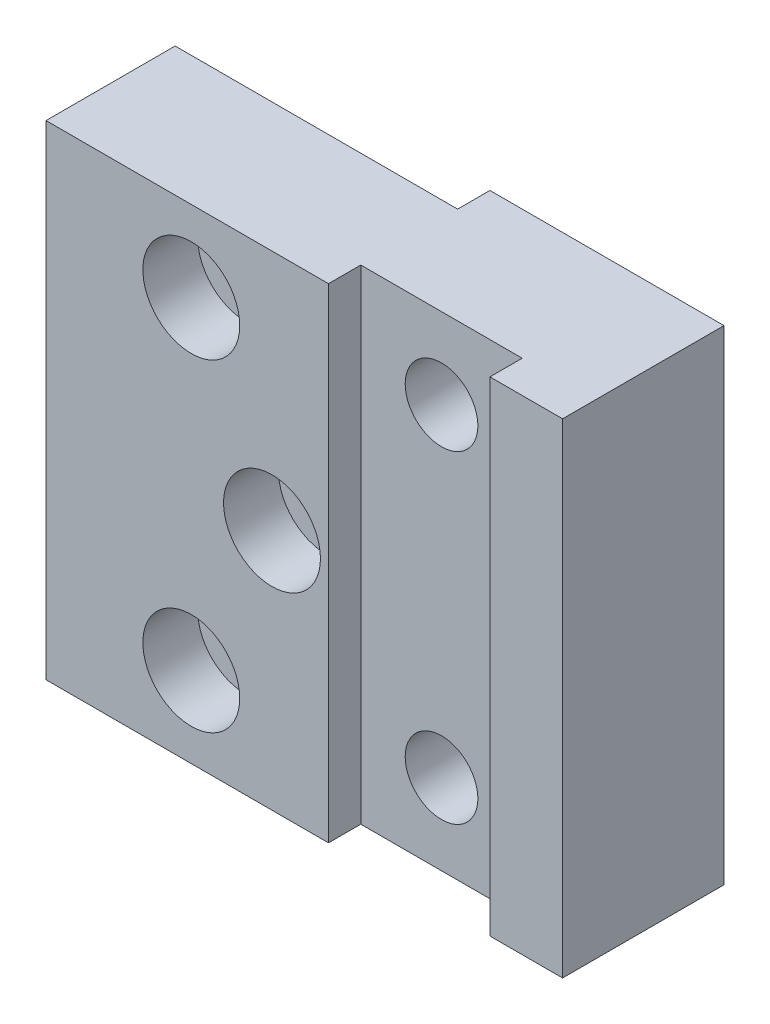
ISO-10303-21;
HEADER;
FILE_DESCRIPTION(('STEP AP214'),'2;1');
FILE_NAME('part.step','',(''),(''),'','','');
FILE_SCHEMA(('AUTOMOTIVE_DESIGN { 1 0 10303 214 1 1 1 1 }'));
ENDSEC;
DATA;
#1=APPLICATION_CONTEXT('core data for automotive mechanical design processes');
#2=APPLICATION_PROTOCOL_DEFINITION('international standard','automotive_design',2000,#1);
#3=PRODUCT_CONTEXT('',#1,'mechanical');
#4=PRODUCT('Part','Part','',(#3));
#5=PRODUCT_RELATED_PRODUCT_CATEGORY('part','',(#4));
#6=PRODUCT_DEFINITION_FORMATION('','',#4);
#7=PRODUCT_DEFINITION_CONTEXT('part definition',#1,'design');
#8=PRODUCT_DEFINITION('design','',#6,#7);
#9=PRODUCT_DEFINITION_SHAPE('','',#8);
#10=(LENGTH_UNIT() NAMED_UNIT(*) SI_UNIT(.MILLI.,.METRE.));
#11=(NAMED_UNIT(*) PLANE_ANGLE_UNIT() SI_UNIT($,.RADIAN.));
#12=(NAMED_UNIT(*) SI_UNIT($,.STERADIAN.) SOLID_ANGLE_UNIT());
#13=UNCERTAINTY_MEASURE_WITH_UNIT(LENGTH_MEASURE(1.E-05),#10,'distance_accuracy_value','');
#14=(GEOMETRIC_REPRESENTATION_CONTEXT(3) GLOBAL_UNCERTAINTY_ASSIGNED_CONTEXT((#13)) GLOBAL_UNIT_ASSIGNED_CONTEXT((#10,
#11,#12)) REPRESENTATION_CONTEXT('',''));
#15=CARTESIAN_POINT('',(0.,0.,0.));
#16=DIRECTION('',(0.,0.,1.));
#17=DIRECTION('',(1.,0.,0.));
#18=AXIS2_PLACEMENT_3D('',#15,#16,#17);
#19=CARTESIAN_POINT('',(0.,0.,10.));
#20=DIRECTION('',(0.,0.,-1.));
#21=DIRECTION('',(-1.,0.,0.));
#22=AXIS2_PLACEMENT_3D('',#19,#20,#21);
#23=PLANE('',#22);
#24=CARTESIAN_POINT('',(5.8,-10.,10.));
#25=DIRECTION('',(0.,0.,1.));
#26=DIRECTION('',(1.,0.,0.));
#27=AXIS2_PLACEMENT_3D('',#24,#25,#26);
#28=CIRCLE('',#27,3.);
#29=CARTESIAN_POINT('',(8.8,-10.,10.));
#30=VERTEX_POINT('',#29);
#31=EDGE_CURVE('E153',#30,#30,#28,.T.);
#32=ORIENTED_EDGE('',*,*,#31,.F.);
#33=EDGE_LOOP('',(#32));
#34=FACE_BOUND('',#33,.T.);
#35=CARTESIAN_POINT('',(10.8,0.,10.));
#36=DIRECTION('',(0.,0.,1.));
#37=DIRECTION('',(1.,0.,0.));
#38=AXIS2_PLACEMENT_3D('',#35,#36,#37);
#39=CIRCLE('',#38,3.);
#40=CARTESIAN_POINT('',(13.8,0.,10.));
#41=VERTEX_POINT('',#40);
#42=EDGE_CURVE('E157',#41,#41,#39,.T.);
#43=ORIENTED_EDGE('',*,*,#42,.F.);
#44=EDGE_LOOP('',(#43));
#45=FACE_BOUND('',#44,.T.);
#46=CARTESIAN_POINT('',(5.8,10.,10.));
#47=DIRECTION('',(0.,0.,1.));
#48=DIRECTION('',(1.,0.,0.));
#49=AXIS2_PLACEMENT_3D('',#46,#47,#48);
#50=CIRCLE('',#49,3.);
#51=CARTESIAN_POINT('',(8.8,10.,10.));
#52=VERTEX_POINT('',#51);
#53=EDGE_CURVE('E184',#52,#52,#50,.T.);
#54=ORIENTED_EDGE('',*,*,#53,.F.);
#55=EDGE_LOOP('',(#54));
#56=FACE_BOUND('',#55,.T.);
#57=DIRECTION('',(1.,0.,0.));
#58=VECTOR('',#57,1.);
#59=CARTESIAN_POINT('',(-3.2,-15.,10.));
#60=LINE('',#59,#58);
#61=CARTESIAN_POINT('',(-3.2,-15.,10.));
#62=VERTEX_POINT('',#61);
#63=CARTESIAN_POINT('',(14.3,-15.,10.));
#64=VERTEX_POINT('',#63);
#65=EDGE_CURVE('E110',#62,#64,#60,.T.);
#66=ORIENTED_EDGE('',*,*,#65,.T.);
#67=DIRECTION('',(0.,1.,0.));
#68=VECTOR('',#67,1.);
#69=CARTESIAN_POINT('',(14.3,-15.,10.));
#70=LINE('',#69,#68);
#71=CARTESIAN_POINT('',(14.3,15.,10.));
#72=VERTEX_POINT('',#71);
#73=EDGE_CURVE('E95',#64,#72,#70,.T.);
#74=ORIENTED_EDGE('',*,*,#73,.T.);
#75=DIRECTION('',(-1.,0.,0.));
#76=VECTOR('',#75,1.);
#77=CARTESIAN_POINT('',(-3.2,15.,10.));
#78=LINE('',#77,#76);
#79=CARTESIAN_POINT('',(-3.2,15.,10.));
#80=VERTEX_POINT('',#79);
#81=EDGE_CURVE('E121',#72,#80,#78,.T.);
#82=ORIENTED_EDGE('',*,*,#81,.T.);
#83=DIRECTION('',(0.,-1.,0.));
#84=VECTOR('',#83,1.);
#85=CARTESIAN_POINT('',(-3.2,-15.,10.));
#86=LINE('',#85,#84);
#87=EDGE_CURVE('E116',#80,#62,#86,.T.);
#88=ORIENTED_EDGE('',*,*,#87,.T.);
#89=EDGE_LOOP('',(#66,#74,#82,#88));
#90=FACE_BOUND('',#89,.T.);
#91=ADVANCED_FACE('F16',(#34,#45,#56,#90),#23,.F.);
#92=CARTESIAN_POINT('',(-3.2,-15.,10.));
#93=DIRECTION('',(1.,0.,0.));
#94=DIRECTION('',(0.,0.,-1.));
#95=AXIS2_PLACEMENT_3D('',#92,#93,#94);
#96=PLANE('',#95);
#97=DIRECTION('',(0.,0.,-1.));
#98=VECTOR('',#97,1.);
#99=CARTESIAN_POINT('',(-3.2,15.,10.));
#100=LINE('',#99,#98);
#101=CARTESIAN_POINT('',(-3.2,15.,2.));
#102=VERTEX_POINT('',#101);
#103=EDGE_CURVE('E129',#80,#102,#100,.T.);
#104=ORIENTED_EDGE('',*,*,#103,.T.);
#105=DIRECTION('',(0.,1.,0.));
#106=VECTOR('',#105,1.);
#107=CARTESIAN_POINT('',(-3.2,-15.,2.));
#108=LINE('',#107,#106);
#109=CARTESIAN_POINT('',(-3.2,-15.,2.));
#110=VERTEX_POINT('',#109);
#111=EDGE_CURVE('E215',#110,#102,#108,.T.);
#112=ORIENTED_EDGE('',*,*,#111,.F.);
#113=DIRECTION('',(0.,0.,-1.));
#114=VECTOR('',#113,1.);
#115=CARTESIAN_POINT('',(-3.2,-15.,10.));
#116=LINE('',#115,#114);
#117=EDGE_CURVE('E11',#62,#110,#116,.T.);
#118=ORIENTED_EDGE('',*,*,#117,.F.);
#119=ORIENTED_EDGE('',*,*,#87,.F.);
#120=EDGE_LOOP('',(#104,#112,#118,#119));
#121=FACE_BOUND('',#120,.T.);
#122=ADVANCED_FACE('F18',(#121),#96,.F.);
#123=CARTESIAN_POINT('',(-3.2,-15.,10.));
#124=DIRECTION('',(0.,1.,0.));
#125=DIRECTION('',(0.,0.,1.));
#126=AXIS2_PLACEMENT_3D('',#123,#124,#125);
#127=PLANE('',#126);
#128=DIRECTION('',(-1.,0.,0.));
#129=VECTOR('',#128,1.);
#130=CARTESIAN_POINT('',(14.3,-15.,8.));
#131=LINE('',#130,#129);
#132=CARTESIAN_POINT('',(24.3,-15.,8.));
#133=VERTEX_POINT('',#132);
#134=CARTESIAN_POINT('',(14.3,-15.,8.));
#135=VERTEX_POINT('',#134);
#136=EDGE_CURVE('E106',#133,#135,#131,.T.);
#137=ORIENTED_EDGE('',*,*,#136,.T.);
#138=DIRECTION('',(0.,0.,1.));
#139=VECTOR('',#138,1.);
#140=CARTESIAN_POINT('',(14.3,-15.,10.));
#141=LINE('',#140,#139);
#142=EDGE_CURVE('E98',#135,#64,#141,.T.);
#143=ORIENTED_EDGE('',*,*,#142,.T.);
#144=ORIENTED_EDGE('',*,*,#65,.F.);
#145=ORIENTED_EDGE('',*,*,#117,.T.);
#146=DIRECTION('',(1.,0.,0.));
#147=VECTOR('',#146,1.);
#148=CARTESIAN_POINT('',(-3.2,-15.,2.));
#149=LINE('',#148,#147);
#150=CARTESIAN_POINT('',(14.3,-15.,2.));
#151=VERTEX_POINT('',#150);
#152=EDGE_CURVE('E209',#110,#151,#149,.T.);
#153=ORIENTED_EDGE('',*,*,#152,.T.);
#154=DIRECTION('',(0.,0.,-1.));
#155=VECTOR('',#154,1.);
#156=CARTESIAN_POINT('',(14.3,-15.,0.));
#157=LINE('',#156,#155);
#158=CARTESIAN_POINT('',(14.3,-15.,0.));
#159=VERTEX_POINT('',#158);
#160=EDGE_CURVE('E212',#151,#159,#157,.T.);
#161=ORIENTED_EDGE('',*,*,#160,.T.);
#162=DIRECTION('',(1.,0.,0.));
#163=VECTOR('',#162,1.);
#164=CARTESIAN_POINT('',(-3.2,-15.,0.));
#165=LINE('',#164,#163);
#166=CARTESIAN_POINT('',(28.8,-15.,0.));
#167=VERTEX_POINT('',#166);
#168=EDGE_CURVE('E130',#159,#167,#165,.T.);
#169=ORIENTED_EDGE('',*,*,#168,.T.);
#170=DIRECTION('',(0.,0.,-1.));
#171=VECTOR('',#170,1.);
#172=CARTESIAN_POINT('',(28.8,-15.,10.));
#173=LINE('',#172,#171);
#174=CARTESIAN_POINT('',(28.8,-15.,10.));
#175=VERTEX_POINT('',#174);
#176=EDGE_CURVE('E25',#175,#167,#173,.T.);
#177=ORIENTED_EDGE('',*,*,#176,.F.);
#178=CARTESIAN_POINT('',(24.3,-15.,10.));
#179=VERTEX_POINT('',#178);
#180=EDGE_CURVE('E119',#179,#175,#60,.T.);
#181=ORIENTED_EDGE('',*,*,#180,.F.);
#182=DIRECTION('',(0.,0.,-1.));
#183=VECTOR('',#182,1.);
#184=CARTESIAN_POINT('',(24.3,-15.,10.));
#185=LINE('',#184,#183);
#186=EDGE_CURVE('E33',#179,#133,#185,.T.);
#187=ORIENTED_EDGE('',*,*,#186,.T.);
#188=EDGE_LOOP('',(#137,#143,#144,#145,#153,#161,#169,#177,#181,#187));
#189=FACE_BOUND('',#188,.T.);
#190=ADVANCED_FACE('F109',(#189),#127,.F.);
#191=CARTESIAN_POINT('',(28.8,-15.,10.));
#192=DIRECTION('',(-1.,0.,0.));
#193=DIRECTION('',(0.,0.,1.));
#194=AXIS2_PLACEMENT_3D('',#191,#192,#193);
#195=PLANE('',#194);
#196=DIRECTION('',(0.,1.,0.));
#197=VECTOR('',#196,1.);
#198=CARTESIAN_POINT('',(28.8,-15.,0.));
#199=LINE('',#198,#197);
#200=CARTESIAN_POINT('',(28.8,15.,0.));
#201=VERTEX_POINT('',#200);
#202=EDGE_CURVE('E132',#167,#201,#199,.T.);
#203=ORIENTED_EDGE('',*,*,#202,.T.);
#204=DIRECTION('',(0.,0.,-1.));
#205=VECTOR('',#204,1.);
#206=CARTESIAN_POINT('',(28.8,15.,10.));
#207=LINE('',#206,#205);
#208=CARTESIAN_POINT('',(28.8,15.,10.));
#209=VERTEX_POINT('',#208);
#210=EDGE_CURVE('E140',#209,#201,#207,.T.);
#211=ORIENTED_EDGE('',*,*,#210,.F.);
#212=DIRECTION('',(0.,1.,0.));
#213=VECTOR('',#212,1.);
#214=CARTESIAN_POINT('',(28.8,-15.,10.));
#215=LINE('',#214,#213);
#216=EDGE_CURVE('E118',#175,#209,#215,.T.);
#217=ORIENTED_EDGE('',*,*,#216,.F.);
#218=ORIENTED_EDGE('',*,*,#176,.T.);
#219=EDGE_LOOP('',(#203,#211,#217,#218));
#220=FACE_BOUND('',#219,.T.);
#221=ADVANCED_FACE('F238',(#220),#195,.F.);
#222=CARTESIAN_POINT('',(-3.2,15.,10.));
#223=DIRECTION('',(0.,-1.,0.));
#224=DIRECTION('',(0.,0.,-1.));
#225=AXIS2_PLACEMENT_3D('',#222,#223,#224);
#226=PLANE('',#225);
#227=ORIENTED_EDGE('',*,*,#81,.F.);
#228=DIRECTION('',(0.,0.,1.));
#229=VECTOR('',#228,1.);
#230=CARTESIAN_POINT('',(14.3,15.,10.));
#231=LINE('',#230,#229);
#232=CARTESIAN_POINT('',(14.3,15.,8.));
#233=VERTEX_POINT('',#232);
#234=EDGE_CURVE('E101',#233,#72,#231,.T.);
#235=ORIENTED_EDGE('',*,*,#234,.F.);
#236=DIRECTION('',(-1.,0.,0.));
#237=VECTOR('',#236,1.);
#238=CARTESIAN_POINT('',(14.3,15.,8.));
#239=LINE('',#238,#237);
#240=CARTESIAN_POINT('',(24.3,15.,8.));
#241=VERTEX_POINT('',#240);
#242=EDGE_CURVE('E113',#241,#233,#239,.T.);
#243=ORIENTED_EDGE('',*,*,#242,.F.);
#244=DIRECTION('',(0.,0.,-1.));
#245=VECTOR('',#244,1.);
#246=CARTESIAN_POINT('',(24.3,15.,10.));
#247=LINE('',#246,#245);
#248=CARTESIAN_POINT('',(24.3,15.,10.));
#249=VERTEX_POINT('',#248);
#250=EDGE_CURVE('E164',#249,#241,#247,.T.);
#251=ORIENTED_EDGE('',*,*,#250,.F.);
#252=EDGE_CURVE('E126',#209,#249,#78,.T.);
#253=ORIENTED_EDGE('',*,*,#252,.F.);
#254=ORIENTED_EDGE('',*,*,#210,.T.);
#255=DIRECTION('',(-1.,0.,0.));
#256=VECTOR('',#255,1.);
#257=CARTESIAN_POINT('',(-3.2,15.,0.));
#258=LINE('',#257,#256);
#259=CARTESIAN_POINT('',(14.3,15.,0.));
#260=VERTEX_POINT('',#259);
#261=EDGE_CURVE('E135',#201,#260,#258,.T.);
#262=ORIENTED_EDGE('',*,*,#261,.T.);
#263=DIRECTION('',(0.,0.,-1.));
#264=VECTOR('',#263,1.);
#265=CARTESIAN_POINT('',(14.3,15.,0.));
#266=LINE('',#265,#264);
#267=CARTESIAN_POINT('',(14.3,15.,2.));
#268=VERTEX_POINT('',#267);
#269=EDGE_CURVE('E41',#268,#260,#266,.T.);
#270=ORIENTED_EDGE('',*,*,#269,.F.);
#271=DIRECTION('',(1.,0.,0.));
#272=VECTOR('',#271,1.);
#273=CARTESIAN_POINT('',(-3.2,15.,2.));
#274=LINE('',#273,#272);
#275=EDGE_CURVE('E148',#102,#268,#274,.T.);
#276=ORIENTED_EDGE('',*,*,#275,.F.);
#277=ORIENTED_EDGE('',*,*,#103,.F.);
#278=EDGE_LOOP('',(#227,#235,#243,#251,#253,#254,#262,#270,#276,#277));
#279=FACE_BOUND('',#278,.T.);
#280=ADVANCED_FACE('F228',(#279),#226,.F.);
#281=ORIENTED_EDGE('',*,*,#252,.T.);
#282=DIRECTION('',(0.,1.,0.));
#283=VECTOR('',#282,1.);
#284=CARTESIAN_POINT('',(24.3,-15.,10.));
#285=LINE('',#284,#283);
#286=EDGE_CURVE('E105',#179,#249,#285,.T.);
#287=ORIENTED_EDGE('',*,*,#286,.F.);
#288=ORIENTED_EDGE('',*,*,#180,.T.);
#289=ORIENTED_EDGE('',*,*,#216,.T.);
#290=EDGE_LOOP('',(#281,#287,#288,#289));
#291=FACE_BOUND('',#290,.T.);
#292=ADVANCED_FACE('F244',(#291),#23,.F.);
#293=CARTESIAN_POINT('',(0.,0.,0.));
#294=DIRECTION('',(0.,0.,-1.));
#295=DIRECTION('',(-1.,0.,0.));
#296=AXIS2_PLACEMENT_3D('',#293,#294,#295);
#297=PLANE('',#296);
#298=CARTESIAN_POINT('',(19.3,10.,0.));
#299=DIRECTION('',(0.,0.,-1.));
#300=DIRECTION('',(-1.,0.,0.));
#301=AXIS2_PLACEMENT_3D('',#298,#299,#300);
#302=CIRCLE('',#301,4.);
#303=CARTESIAN_POINT('',(15.3,10.,0.));
#304=VERTEX_POINT('',#303);
#305=EDGE_CURVE('E508',#304,#304,#302,.T.);
#306=ORIENTED_EDGE('',*,*,#305,.F.);
#307=EDGE_LOOP('',(#306));
#308=FACE_BOUND('',#307,.T.);
#309=CARTESIAN_POINT('',(19.3,-10.,0.));
#310=DIRECTION('',(0.,0.,-1.));
#311=DIRECTION('',(-1.,0.,0.));
#312=AXIS2_PLACEMENT_3D('',#309,#310,#311);
#313=CIRCLE('',#312,4.);
#314=CARTESIAN_POINT('',(15.3,-10.,0.));
#315=VERTEX_POINT('',#314);
#316=EDGE_CURVE('E172',#315,#315,#313,.T.);
#317=ORIENTED_EDGE('',*,*,#316,.F.);
#318=EDGE_LOOP('',(#317));
#319=FACE_BOUND('',#318,.T.);
#320=DIRECTION('',(0.,1.,0.));
#321=VECTOR('',#320,1.);
#322=CARTESIAN_POINT('',(14.3,-15.,0.));
#323=LINE('',#322,#321);
#324=EDGE_CURVE('E133',#159,#260,#323,.T.);
#325=ORIENTED_EDGE('',*,*,#324,.T.);
#326=ORIENTED_EDGE('',*,*,#261,.F.);
#327=ORIENTED_EDGE('',*,*,#202,.F.);
#328=ORIENTED_EDGE('',*,*,#168,.F.);
#329=EDGE_LOOP('',(#325,#326,#327,#328));
#330=FACE_BOUND('',#329,.T.);
#331=ADVANCED_FACE('F234',(#308,#319,#330),#297,.T.);
#332=CARTESIAN_POINT('',(14.3,-15.,0.));
#333=DIRECTION('',(1.,0.,0.));
#334=DIRECTION('',(0.,0.,-1.));
#335=AXIS2_PLACEMENT_3D('',#332,#333,#334);
#336=PLANE('',#335);
#337=ORIENTED_EDGE('',*,*,#269,.T.);
#338=ORIENTED_EDGE('',*,*,#324,.F.);
#339=ORIENTED_EDGE('',*,*,#160,.F.);
#340=DIRECTION('',(0.,1.,0.));
#341=VECTOR('',#340,1.);
#342=CARTESIAN_POINT('',(14.3,-15.,2.));
#343=LINE('',#342,#341);
#344=EDGE_CURVE('E220',#151,#268,#343,.T.);
#345=ORIENTED_EDGE('',*,*,#344,.T.);
#346=EDGE_LOOP('',(#337,#338,#339,#345));
#347=FACE_BOUND('',#346,.T.);
#348=ADVANCED_FACE('F281',(#347),#336,.F.);
#349=CARTESIAN_POINT('',(-3.2,-15.,2.));
#350=DIRECTION('',(0.,0.,1.));
#351=DIRECTION('',(1.,0.,0.));
#352=AXIS2_PLACEMENT_3D('',#349,#350,#351);
#353=PLANE('',#352);
#354=CARTESIAN_POINT('',(5.8,10.,2.));
#355=DIRECTION('',(0.,0.,1.));
#356=DIRECTION('',(1.,0.,0.));
#357=AXIS2_PLACEMENT_3D('',#354,#355,#356);
#358=CIRCLE('',#357,1.7);
#359=CARTESIAN_POINT('',(7.5,10.,2.));
#360=VERTEX_POINT('',#359);
#361=EDGE_CURVE('E155',#360,#360,#358,.T.);
#362=ORIENTED_EDGE('',*,*,#361,.T.);
#363=EDGE_LOOP('',(#362));
#364=FACE_BOUND('',#363,.T.);
#365=CARTESIAN_POINT('',(10.8,0.,2.));
#366=DIRECTION('',(0.,0.,1.));
#367=DIRECTION('',(1.,0.,0.));
#368=AXIS2_PLACEMENT_3D('',#365,#366,#367);
#369=CIRCLE('',#368,1.7);
#370=CARTESIAN_POINT('',(12.5,0.,2.));
#371=VERTEX_POINT('',#370);
#372=EDGE_CURVE('E150',#371,#371,#369,.T.);
#373=ORIENTED_EDGE('',*,*,#372,.T.);
#374=EDGE_LOOP('',(#373));
#375=FACE_BOUND('',#374,.T.);
#376=CARTESIAN_POINT('',(5.8,-10.,2.));
#377=DIRECTION('',(0.,0.,1.));
#378=DIRECTION('',(1.,0.,0.));
#379=AXIS2_PLACEMENT_3D('',#376,#377,#378);
#380=CIRCLE('',#379,1.7);
#381=CARTESIAN_POINT('',(7.5,-10.,2.));
#382=VERTEX_POINT('',#381);
#383=EDGE_CURVE('E145',#382,#382,#380,.T.);
#384=ORIENTED_EDGE('',*,*,#383,.T.);
#385=EDGE_LOOP('',(#384));
#386=FACE_BOUND('',#385,.T.);
#387=ORIENTED_EDGE('',*,*,#275,.T.);
#388=ORIENTED_EDGE('',*,*,#344,.F.);
#389=ORIENTED_EDGE('',*,*,#152,.F.);
#390=ORIENTED_EDGE('',*,*,#111,.T.);
#391=EDGE_LOOP('',(#387,#388,#389,#390));
#392=FACE_BOUND('',#391,.T.);
#393=ADVANCED_FACE('F224',(#364,#375,#386,#392),#353,.F.);
#394=CARTESIAN_POINT('',(5.8,-10.,10.));
#395=DIRECTION('',(0.,0.,1.));
#396=DIRECTION('',(1.,0.,0.));
#397=AXIS2_PLACEMENT_3D('',#394,#395,#396);
#398=CYLINDRICAL_SURFACE('',#397,1.7);
#399=CARTESIAN_POINT('',(5.8,-10.,6.6));
#400=DIRECTION('',(0.,0.,1.));
#401=DIRECTION('',(1.,0.,0.));
#402=AXIS2_PLACEMENT_3D('',#399,#400,#401);
#403=CIRCLE('',#402,1.7);
#404=CARTESIAN_POINT('',(7.5,-10.,6.6));
#405=VERTEX_POINT('',#404);
#406=EDGE_CURVE('E149',#405,#405,#403,.T.);
#407=ORIENTED_EDGE('',*,*,#406,.T.);
#408=EDGE_LOOP('',(#407));
#409=FACE_BOUND('',#408,.T.);
#410=ORIENTED_EDGE('',*,*,#383,.F.);
#411=EDGE_LOOP('',(#410));
#412=FACE_BOUND('',#411,.T.);
#413=ADVANCED_FACE('F336',(#409,#412),#398,.F.);
#414=CARTESIAN_POINT('',(7.5,-10.,6.6));
#415=DIRECTION('',(0.,0.,-1.));
#416=DIRECTION('',(-1.,0.,0.));
#417=AXIS2_PLACEMENT_3D('',#414,#415,#416);
#418=PLANE('',#417);
#419=ORIENTED_EDGE('',*,*,#406,.F.);
#420=EDGE_LOOP('',(#419));
#421=FACE_BOUND('',#420,.T.);
#422=CARTESIAN_POINT('',(5.8,-10.,6.6));
#423=DIRECTION('',(0.,0.,1.));
#424=DIRECTION('',(1.,0.,0.));
#425=AXIS2_PLACEMENT_3D('',#422,#423,#424);
#426=CIRCLE('',#425,3.);
#427=CARTESIAN_POINT('',(8.8,-10.,6.6));
#428=VERTEX_POINT('',#427);
#429=EDGE_CURVE('E204',#428,#428,#426,.T.);
#430=ORIENTED_EDGE('',*,*,#429,.T.);
#431=EDGE_LOOP('',(#430));
#432=FACE_BOUND('',#431,.T.);
#433=ADVANCED_FACE('F345',(#421,#432),#418,.F.);
#434=CARTESIAN_POINT('',(5.8,-10.,10.));
#435=DIRECTION('',(0.,0.,1.));
#436=DIRECTION('',(1.,0.,0.));
#437=AXIS2_PLACEMENT_3D('',#434,#435,#436);
#438=CYLINDRICAL_SURFACE('',#437,3.);
#439=ORIENTED_EDGE('',*,*,#429,.F.);
#440=EDGE_LOOP('',(#439));
#441=FACE_BOUND('',#440,.T.);
#442=ORIENTED_EDGE('',*,*,#31,.T.);
#443=EDGE_LOOP('',(#442));
#444=FACE_BOUND('',#443,.T.);
#445=ADVANCED_FACE('F355',(#441,#444),#438,.F.);
#446=CARTESIAN_POINT('',(10.8,0.,10.));
#447=DIRECTION('',(0.,0.,1.));
#448=DIRECTION('',(1.,0.,0.));
#449=AXIS2_PLACEMENT_3D('',#446,#447,#448);
#450=CYLINDRICAL_SURFACE('',#449,1.7);
#451=CARTESIAN_POINT('',(10.8,0.,6.6));
#452=DIRECTION('',(0.,0.,1.));
#453=DIRECTION('',(1.,0.,0.));
#454=AXIS2_PLACEMENT_3D('',#451,#452,#453);
#455=CIRCLE('',#454,1.7);
#456=CARTESIAN_POINT('',(12.5,0.,6.6));
#457=VERTEX_POINT('',#456);
#458=EDGE_CURVE('E154',#457,#457,#455,.T.);
#459=ORIENTED_EDGE('',*,*,#458,.T.);
#460=EDGE_LOOP('',(#459));
#461=FACE_BOUND('',#460,.T.);
#462=ORIENTED_EDGE('',*,*,#372,.F.);
#463=EDGE_LOOP('',(#462));
#464=FACE_BOUND('',#463,.T.);
#465=ADVANCED_FACE('F365',(#461,#464),#450,.F.);
#466=CARTESIAN_POINT('',(12.5,0.,6.6));
#467=DIRECTION('',(0.,0.,-1.));
#468=DIRECTION('',(-1.,0.,0.));
#469=AXIS2_PLACEMENT_3D('',#466,#467,#468);
#470=PLANE('',#469);
#471=ORIENTED_EDGE('',*,*,#458,.F.);
#472=EDGE_LOOP('',(#471));
#473=FACE_BOUND('',#472,.T.);
#474=CARTESIAN_POINT('',(10.8,0.,6.6));
#475=DIRECTION('',(0.,0.,1.));
#476=DIRECTION('',(1.,0.,0.));
#477=AXIS2_PLACEMENT_3D('',#474,#475,#476);
#478=CIRCLE('',#477,3.);
#479=CARTESIAN_POINT('',(13.8,0.,6.6));
#480=VERTEX_POINT('',#479);
#481=EDGE_CURVE('E197',#480,#480,#478,.T.);
#482=ORIENTED_EDGE('',*,*,#481,.T.);
#483=EDGE_LOOP('',(#482));
#484=FACE_BOUND('',#483,.T.);
#485=ADVANCED_FACE('F375',(#473,#484),#470,.F.);
#486=CARTESIAN_POINT('',(10.8,0.,10.));
#487=DIRECTION('',(0.,0.,1.));
#488=DIRECTION('',(1.,0.,0.));
#489=AXIS2_PLACEMENT_3D('',#486,#487,#488);
#490=CYLINDRICAL_SURFACE('',#489,3.);
#491=ORIENTED_EDGE('',*,*,#481,.F.);
#492=EDGE_LOOP('',(#491));
#493=FACE_BOUND('',#492,.T.);
#494=ORIENTED_EDGE('',*,*,#42,.T.);
#495=EDGE_LOOP('',(#494));
#496=FACE_BOUND('',#495,.T.);
#497=ADVANCED_FACE('F385',(#493,#496),#490,.F.);
#498=CARTESIAN_POINT('',(5.8,10.,10.));
#499=DIRECTION('',(0.,0.,1.));
#500=DIRECTION('',(1.,0.,0.));
#501=AXIS2_PLACEMENT_3D('',#498,#499,#500);
#502=CYLINDRICAL_SURFACE('',#501,1.7);
#503=CARTESIAN_POINT('',(5.8,10.,6.6));
#504=DIRECTION('',(0.,0.,1.));
#505=DIRECTION('',(1.,0.,0.));
#506=AXIS2_PLACEMENT_3D('',#503,#504,#505);
#507=CIRCLE('',#506,1.7);
#508=CARTESIAN_POINT('',(7.5,10.,6.6));
#509=VERTEX_POINT('',#508);
#510=EDGE_CURVE('E158',#509,#509,#507,.T.);
#511=ORIENTED_EDGE('',*,*,#510,.T.);
#512=EDGE_LOOP('',(#511));
#513=FACE_BOUND('',#512,.T.);
#514=ORIENTED_EDGE('',*,*,#361,.F.);
#515=EDGE_LOOP('',(#514));
#516=FACE_BOUND('',#515,.T.);
#517=ADVANCED_FACE('F395',(#513,#516),#502,.F.);
#518=CARTESIAN_POINT('',(7.5,10.,6.6));
#519=DIRECTION('',(0.,0.,-1.));
#520=DIRECTION('',(-1.,0.,0.));
#521=AXIS2_PLACEMENT_3D('',#518,#519,#520);
#522=PLANE('',#521);
#523=ORIENTED_EDGE('',*,*,#510,.F.);
#524=EDGE_LOOP('',(#523));
#525=FACE_BOUND('',#524,.T.);
#526=CARTESIAN_POINT('',(5.8,10.,6.6));
#527=DIRECTION('',(0.,0.,1.));
#528=DIRECTION('',(1.,0.,0.));
#529=AXIS2_PLACEMENT_3D('',#526,#527,#528);
#530=CIRCLE('',#529,3.);
#531=CARTESIAN_POINT('',(8.8,10.,6.6));
#532=VERTEX_POINT('',#531);
#533=EDGE_CURVE('E190',#532,#532,#530,.T.);
#534=ORIENTED_EDGE('',*,*,#533,.T.);
#535=EDGE_LOOP('',(#534));
#536=FACE_BOUND('',#535,.T.);
#537=ADVANCED_FACE('F405',(#525,#536),#522,.F.);
#538=CARTESIAN_POINT('',(5.8,10.,10.));
#539=DIRECTION('',(0.,0.,1.));
#540=DIRECTION('',(1.,0.,0.));
#541=AXIS2_PLACEMENT_3D('',#538,#539,#540);
#542=CYLINDRICAL_SURFACE('',#541,3.);
#543=ORIENTED_EDGE('',*,*,#533,.F.);
#544=EDGE_LOOP('',(#543));
#545=FACE_BOUND('',#544,.T.);
#546=ORIENTED_EDGE('',*,*,#53,.T.);
#547=EDGE_LOOP('',(#546));
#548=FACE_BOUND('',#547,.T.);
#549=ADVANCED_FACE('F260',(#545,#548),#542,.F.);
#550=CARTESIAN_POINT('',(14.3,-15.,10.));
#551=DIRECTION('',(-1.,0.,0.));
#552=DIRECTION('',(0.,0.,1.));
#553=AXIS2_PLACEMENT_3D('',#550,#551,#552);
#554=PLANE('',#553);
#555=ORIENTED_EDGE('',*,*,#234,.T.);
#556=ORIENTED_EDGE('',*,*,#73,.F.);
#557=ORIENTED_EDGE('',*,*,#142,.F.);
#558=DIRECTION('',(0.,1.,0.));
#559=VECTOR('',#558,1.);
#560=CARTESIAN_POINT('',(14.3,-15.,8.));
#561=LINE('',#560,#559);
#562=EDGE_CURVE('E182',#135,#233,#561,.T.);
#563=ORIENTED_EDGE('',*,*,#562,.T.);
#564=EDGE_LOOP('',(#555,#556,#557,#563));
#565=FACE_BOUND('',#564,.T.);
#566=ADVANCED_FACE('F97',(#565),#554,.F.);
#567=CARTESIAN_POINT('',(14.3,-15.,8.));
#568=DIRECTION('',(0.,0.,-1.));
#569=DIRECTION('',(-1.,0.,0.));
#570=AXIS2_PLACEMENT_3D('',#567,#568,#569);
#571=PLANE('',#570);
#572=CARTESIAN_POINT('',(19.3,10.,8.));
#573=DIRECTION('',(0.,0.,-1.));
#574=DIRECTION('',(-1.,0.,0.));
#575=AXIS2_PLACEMENT_3D('',#572,#573,#574);
#576=CIRCLE('',#575,2.25);
#577=CARTESIAN_POINT('',(17.05,10.,8.));
#578=VERTEX_POINT('',#577);
#579=EDGE_CURVE('E20',#578,#578,#576,.T.);
#580=ORIENTED_EDGE('',*,*,#579,.T.);
#581=EDGE_LOOP('',(#580));
#582=FACE_BOUND('',#581,.T.);
#583=CARTESIAN_POINT('',(19.3,-10.,8.));
#584=DIRECTION('',(0.,0.,-1.));
#585=DIRECTION('',(-1.,0.,0.));
#586=AXIS2_PLACEMENT_3D('',#583,#584,#585);
#587=CIRCLE('',#586,2.25);
#588=CARTESIAN_POINT('',(17.05,-10.,8.));
#589=VERTEX_POINT('',#588);
#590=EDGE_CURVE('E159',#589,#589,#587,.T.);
#591=ORIENTED_EDGE('',*,*,#590,.T.);
#592=EDGE_LOOP('',(#591));
#593=FACE_BOUND('',#592,.T.);
#594=ORIENTED_EDGE('',*,*,#242,.T.);
#595=ORIENTED_EDGE('',*,*,#562,.F.);
#596=ORIENTED_EDGE('',*,*,#136,.F.);
#597=DIRECTION('',(0.,1.,0.));
#598=VECTOR('',#597,1.);
#599=CARTESIAN_POINT('',(24.3,-15.,8.));
#600=LINE('',#599,#598);
#601=EDGE_CURVE('E185',#133,#241,#600,.T.);
#602=ORIENTED_EDGE('',*,*,#601,.T.);
#603=EDGE_LOOP('',(#594,#595,#596,#602));
#604=FACE_BOUND('',#603,.T.);
#605=ADVANCED_FACE('F248',(#582,#593,#604),#571,.F.);
#606=CARTESIAN_POINT('',(24.3,-15.,10.));
#607=DIRECTION('',(1.,0.,0.));
#608=DIRECTION('',(0.,0.,-1.));
#609=AXIS2_PLACEMENT_3D('',#606,#607,#608);
#610=PLANE('',#609);
#611=ORIENTED_EDGE('',*,*,#250,.T.);
#612=ORIENTED_EDGE('',*,*,#601,.F.);
#613=ORIENTED_EDGE('',*,*,#186,.F.);
#614=ORIENTED_EDGE('',*,*,#286,.T.);
#615=EDGE_LOOP('',(#611,#612,#613,#614));
#616=FACE_BOUND('',#615,.T.);
#617=ADVANCED_FACE('F246',(#616),#610,.F.);
#618=CARTESIAN_POINT('',(19.3,-10.,0.));
#619=DIRECTION('',(0.,0.,-1.));
#620=DIRECTION('',(-1.,0.,0.));
#621=AXIS2_PLACEMENT_3D('',#618,#619,#620);
#622=CYLINDRICAL_SURFACE('',#621,2.25);
#623=CARTESIAN_POINT('',(19.3,-10.,4.6));
#624=DIRECTION('',(0.,0.,-1.));
#625=DIRECTION('',(-1.,0.,0.));
#626=AXIS2_PLACEMENT_3D('',#623,#624,#625);
#627=CIRCLE('',#626,2.25);
#628=CARTESIAN_POINT('',(17.05,-10.,4.6));
#629=VERTEX_POINT('',#628);
#630=EDGE_CURVE('E161',#629,#629,#627,.T.);
#631=ORIENTED_EDGE('',*,*,#630,.T.);
#632=EDGE_LOOP('',(#631));
#633=FACE_BOUND('',#632,.T.);
#634=ORIENTED_EDGE('',*,*,#590,.F.);
#635=EDGE_LOOP('',(#634));
#636=FACE_BOUND('',#635,.T.);
#637=ADVANCED_FACE('F258',(#633,#636),#622,.F.);
#638=CARTESIAN_POINT('',(21.55,-10.,4.6));
#639=DIRECTION('',(0.,0.,1.));
#640=DIRECTION('',(1.,0.,0.));
#641=AXIS2_PLACEMENT_3D('',#638,#639,#640);
#642=PLANE('',#641);
#643=ORIENTED_EDGE('',*,*,#630,.F.);
#644=EDGE_LOOP('',(#643));
#645=FACE_BOUND('',#644,.T.);
#646=CARTESIAN_POINT('',(19.3,-10.,4.6));
#647=DIRECTION('',(0.,0.,-1.));
#648=DIRECTION('',(-1.,0.,0.));
#649=AXIS2_PLACEMENT_3D('',#646,#647,#648);
#650=CIRCLE('',#649,4.);
#651=CARTESIAN_POINT('',(15.3,-10.,4.6));
#652=VERTEX_POINT('',#651);
#653=EDGE_CURVE('E167',#652,#652,#650,.T.);
#654=ORIENTED_EDGE('',*,*,#653,.T.);
#655=EDGE_LOOP('',(#654));
#656=FACE_BOUND('',#655,.T.);
#657=ADVANCED_FACE('F448',(#645,#656),#642,.F.);
#658=CARTESIAN_POINT('',(19.3,-10.,0.));
#659=DIRECTION('',(0.,0.,-1.));
#660=DIRECTION('',(-1.,0.,0.));
#661=AXIS2_PLACEMENT_3D('',#658,#659,#660);
#662=CYLINDRICAL_SURFACE('',#661,4.);
#663=ORIENTED_EDGE('',*,*,#653,.F.);
#664=EDGE_LOOP('',(#663));
#665=FACE_BOUND('',#664,.T.);
#666=ORIENTED_EDGE('',*,*,#316,.T.);
#667=EDGE_LOOP('',(#666));
#668=FACE_BOUND('',#667,.T.);
#669=ADVANCED_FACE('F456',(#665,#668),#662,.F.);
#670=CARTESIAN_POINT('',(19.3,10.,0.));
#671=DIRECTION('',(0.,0.,-1.));
#672=DIRECTION('',(-1.,0.,0.));
#673=AXIS2_PLACEMENT_3D('',#670,#671,#672);
#674=CYLINDRICAL_SURFACE('',#673,2.25);
#675=CARTESIAN_POINT('',(19.3,10.,4.6));
#676=DIRECTION('',(0.,0.,-1.));
#677=DIRECTION('',(-1.,0.,0.));
#678=AXIS2_PLACEMENT_3D('',#675,#676,#677);
#679=CIRCLE('',#678,2.25);
#680=CARTESIAN_POINT('',(17.05,10.,4.6));
#681=VERTEX_POINT('',#680);
#682=EDGE_CURVE('E510',#681,#681,#679,.T.);
#683=ORIENTED_EDGE('',*,*,#682,.T.);
#684=EDGE_LOOP('',(#683));
#685=FACE_BOUND('',#684,.T.);
#686=ORIENTED_EDGE('',*,*,#579,.F.);
#687=EDGE_LOOP('',(#686));
#688=FACE_BOUND('',#687,.T.);
#689=ADVANCED_FACE('F466',(#685,#688),#674,.F.);
#690=CARTESIAN_POINT('',(21.55,10.,4.6));
#691=DIRECTION('',(0.,0.,1.));
#692=DIRECTION('',(1.,0.,0.));
#693=AXIS2_PLACEMENT_3D('',#690,#691,#692);
#694=PLANE('',#693);
#695=ORIENTED_EDGE('',*,*,#682,.F.);
#696=EDGE_LOOP('',(#695));
#697=FACE_BOUND('',#696,.T.);
#698=CARTESIAN_POINT('',(19.3,10.,4.6));
#699=DIRECTION('',(0.,0.,-1.));
#700=DIRECTION('',(-1.,0.,0.));
#701=AXIS2_PLACEMENT_3D('',#698,#699,#700);
#702=CIRCLE('',#701,4.);
#703=CARTESIAN_POINT('',(15.3,10.,4.6));
#704=VERTEX_POINT('',#703);
#705=EDGE_CURVE('E505',#704,#704,#702,.T.);
#706=ORIENTED_EDGE('',*,*,#705,.T.);
#707=EDGE_LOOP('',(#706));
#708=FACE_BOUND('',#707,.T.);
#709=ADVANCED_FACE('F476',(#697,#708),#694,.F.);
#710=CARTESIAN_POINT('',(19.3,10.,0.));
#711=DIRECTION('',(0.,0.,-1.));
#712=DIRECTION('',(-1.,0.,0.));
#713=AXIS2_PLACEMENT_3D('',#710,#711,#712);
#714=CYLINDRICAL_SURFACE('',#713,4.);
#715=ORIENTED_EDGE('',*,*,#705,.F.);
#716=EDGE_LOOP('',(#715));
#717=FACE_BOUND('',#716,.T.);
#718=ORIENTED_EDGE('',*,*,#305,.T.);
#719=EDGE_LOOP('',(#718));
#720=FACE_BOUND('',#719,.T.);
#721=ADVANCED_FACE('F486',(#717,#720),#714,.F.);
#722=CLOSED_SHELL('',(#91,#122,#190,#221,#280,#292,#331,#348,#393,#413,#433,#445,#465,#485,#497,
#517,#537,#549,#566,#605,#617,#637,#657,#669,#689,#709,#721));
#723=MANIFOLD_SOLID_BREP('B1',#722);
#724=ADVANCED_BREP_SHAPE_REPRESENTATION('',(#18,#723),#14);
#725=SHAPE_DEFINITION_REPRESENTATION(#9,#724);
ENDSEC;
END-ISO-10303-21;
